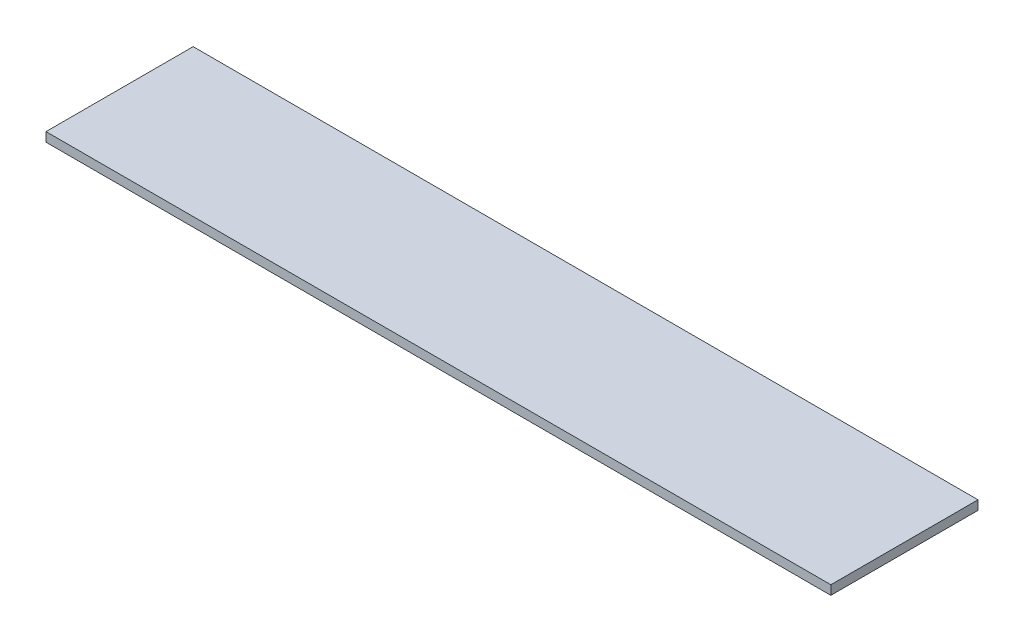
from build123d import *

# Parameters (mm, degrees)
SKETCH2_W           = 1625.6
SKETCH2_H           = 304.8
BOSS_EXTRUDE1_DEPTH = 19.05


with BuildPart() as part:
    # Sketch2 → Boss-Extrude1 (new body)
    with BuildSketch(Plane(origin=(0, 0, 0), x_dir=(1, 0, 0), z_dir=(0, 1, 0))):
        Rectangle(SKETCH2_W, SKETCH2_H)
    extrude(amount=BOSS_EXTRUDE1_DEPTH)


solid = part.part
